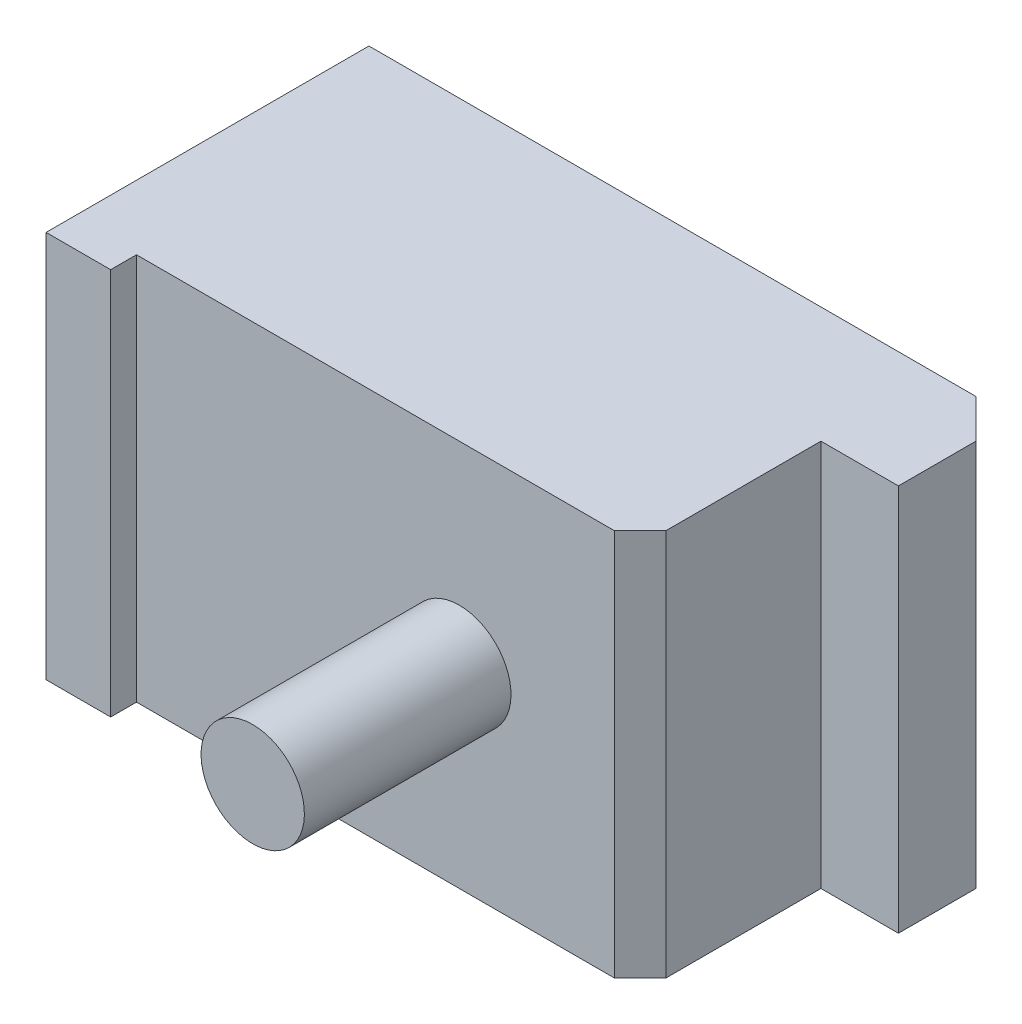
ISO-10303-21;
HEADER;
FILE_DESCRIPTION(('STEP AP214'),'2;1');
FILE_NAME('part.step','',(''),(''),'','','');
FILE_SCHEMA(('AUTOMOTIVE_DESIGN { 1 0 10303 214 1 1 1 1 }'));
ENDSEC;
DATA;
#1=APPLICATION_CONTEXT('core data for automotive mechanical design processes');
#2=APPLICATION_PROTOCOL_DEFINITION('international standard','automotive_design',2000,#1);
#3=PRODUCT_CONTEXT('',#1,'mechanical');
#4=PRODUCT('Part','Part','',(#3));
#5=PRODUCT_RELATED_PRODUCT_CATEGORY('part','',(#4));
#6=PRODUCT_DEFINITION_FORMATION('','',#4);
#7=PRODUCT_DEFINITION_CONTEXT('part definition',#1,'design');
#8=PRODUCT_DEFINITION('design','',#6,#7);
#9=PRODUCT_DEFINITION_SHAPE('','',#8);
#10=(LENGTH_UNIT() NAMED_UNIT(*) SI_UNIT(.MILLI.,.METRE.));
#11=(NAMED_UNIT(*) PLANE_ANGLE_UNIT() SI_UNIT($,.RADIAN.));
#12=(NAMED_UNIT(*) SI_UNIT($,.STERADIAN.) SOLID_ANGLE_UNIT());
#13=UNCERTAINTY_MEASURE_WITH_UNIT(LENGTH_MEASURE(1.E-05),#10,'distance_accuracy_value','');
#14=(GEOMETRIC_REPRESENTATION_CONTEXT(3) GLOBAL_UNCERTAINTY_ASSIGNED_CONTEXT((#13)) GLOBAL_UNIT_ASSIGNED_CONTEXT((#10,
#11,#12)) REPRESENTATION_CONTEXT('',''));
#15=CARTESIAN_POINT('',(0.,0.,0.));
#16=DIRECTION('',(0.,0.,1.));
#17=DIRECTION('',(1.,0.,0.));
#18=AXIS2_PLACEMENT_3D('',#15,#16,#17);
#19=CARTESIAN_POINT('',(25.,-15.,2.));
#20=DIRECTION('',(0.,-1.,0.));
#21=DIRECTION('',(0.,0.,-1.));
#22=AXIS2_PLACEMENT_3D('',#19,#20,#21);
#23=PLANE('',#22);
#24=DIRECTION('',(0.,0.,-1.));
#25=VECTOR('',#24,1.);
#26=CARTESIAN_POINT('',(19.,-15.,2.));
#27=LINE('',#26,#25);
#28=CARTESIAN_POINT('',(19.,-15.,-2.));
#29=VERTEX_POINT('',#28);
#30=CARTESIAN_POINT('',(19.,-15.,-14.));
#31=VERTEX_POINT('',#30);
#32=EDGE_CURVE('E213',#29,#31,#27,.T.);
#33=ORIENTED_EDGE('',*,*,#32,.F.);
#34=DIRECTION('',(0.707106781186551,0.,-0.707106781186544));
#35=VECTOR('',#34,1.);
#36=CARTESIAN_POINT('',(20.,-15.,-3.));
#37=LINE('',#36,#35);
#38=CARTESIAN_POINT('',(17.,-15.,0.));
#39=VERTEX_POINT('',#38);
#40=EDGE_CURVE('E39',#29,#39,#37,.F.);
#41=ORIENTED_EDGE('',*,*,#40,.T.);
#42=DIRECTION('',(1.,0.,0.));
#43=VECTOR('',#42,1.);
#44=CARTESIAN_POINT('',(-20.,-15.,0.));
#45=LINE('',#44,#43);
#46=CARTESIAN_POINT('',(-20.,-15.,0.));
#47=VERTEX_POINT('',#46);
#48=EDGE_CURVE('E205',#47,#39,#45,.T.);
#49=ORIENTED_EDGE('',*,*,#48,.F.);
#50=DIRECTION('',(0.,0.,-1.));
#51=VECTOR('',#50,1.);
#52=CARTESIAN_POINT('',(-20.,-15.,2.));
#53=LINE('',#52,#51);
#54=CARTESIAN_POINT('',(-20.,-15.,2.));
#55=VERTEX_POINT('',#54);
#56=EDGE_CURVE('E200',#55,#47,#53,.T.);
#57=ORIENTED_EDGE('',*,*,#56,.F.);
#58=DIRECTION('',(-1.,0.,0.));
#59=VECTOR('',#58,1.);
#60=CARTESIAN_POINT('',(25.,-15.,2.));
#61=LINE('',#60,#59);
#62=CARTESIAN_POINT('',(-25.,-15.,2.));
#63=VERTEX_POINT('',#62);
#64=EDGE_CURVE('E230',#55,#63,#61,.T.);
#65=ORIENTED_EDGE('',*,*,#64,.T.);
#66=DIRECTION('',(0.,0.,-1.));
#67=VECTOR('',#66,1.);
#68=CARTESIAN_POINT('',(-25.,-15.,2.));
#69=LINE('',#68,#67);
#70=CARTESIAN_POINT('',(-25.,-15.,-23.));
#71=VERTEX_POINT('',#70);
#72=EDGE_CURVE('E239',#63,#71,#69,.T.);
#73=ORIENTED_EDGE('',*,*,#72,.T.);
#74=DIRECTION('',(-1.,0.,0.));
#75=VECTOR('',#74,1.);
#76=CARTESIAN_POINT('',(25.,-15.,-23.));
#77=LINE('',#76,#75);
#78=CARTESIAN_POINT('',(22.,-15.,-23.));
#79=VERTEX_POINT('',#78);
#80=EDGE_CURVE('E227',#79,#71,#77,.T.);
#81=ORIENTED_EDGE('',*,*,#80,.F.);
#82=DIRECTION('',(-0.707106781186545,0.,-0.70710678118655));
#83=VECTOR('',#82,1.);
#84=CARTESIAN_POINT('',(36.,-15.,-9.));
#85=LINE('',#84,#83);
#86=CARTESIAN_POINT('',(25.,-15.,-20.));
#87=VERTEX_POINT('',#86);
#88=EDGE_CURVE('E262',#79,#87,#85,.F.);
#89=ORIENTED_EDGE('',*,*,#88,.T.);
#90=DIRECTION('',(0.,0.,-1.));
#91=VECTOR('',#90,1.);
#92=CARTESIAN_POINT('',(25.,-15.,2.));
#93=LINE('',#92,#91);
#94=CARTESIAN_POINT('',(25.,-15.,-14.));
#95=VERTEX_POINT('',#94);
#96=EDGE_CURVE('E246',#95,#87,#93,.T.);
#97=ORIENTED_EDGE('',*,*,#96,.F.);
#98=DIRECTION('',(1.,0.,0.));
#99=VECTOR('',#98,1.);
#100=CARTESIAN_POINT('',(19.,-15.,-14.));
#101=LINE('',#100,#99);
#102=EDGE_CURVE('E218',#31,#95,#101,.T.);
#103=ORIENTED_EDGE('',*,*,#102,.F.);
#104=EDGE_LOOP('',(#33,#41,#49,#57,#65,#73,#81,#89,#97,#103));
#105=FACE_BOUND('',#104,.T.);
#106=ADVANCED_FACE('F16',(#105),#23,.T.);
#107=CARTESIAN_POINT('',(25.,15.,2.));
#108=DIRECTION('',(1.,0.,0.));
#109=DIRECTION('',(0.,0.,-1.));
#110=AXIS2_PLACEMENT_3D('',#107,#108,#109);
#111=PLANE('',#110);
#112=ORIENTED_EDGE('',*,*,#96,.T.);
#113=DIRECTION('',(0.,1.,0.));
#114=VECTOR('',#113,1.);
#115=CARTESIAN_POINT('',(25.,15.,-20.));
#116=LINE('',#115,#114);
#117=CARTESIAN_POINT('',(25.,15.,-20.));
#118=VERTEX_POINT('',#117);
#119=EDGE_CURVE('E264',#87,#118,#116,.T.);
#120=ORIENTED_EDGE('',*,*,#119,.T.);
#121=DIRECTION('',(0.,0.,-1.));
#122=VECTOR('',#121,1.);
#123=CARTESIAN_POINT('',(25.,15.,2.));
#124=LINE('',#123,#122);
#125=CARTESIAN_POINT('',(25.,15.,-14.));
#126=VERTEX_POINT('',#125);
#127=EDGE_CURVE('E250',#126,#118,#124,.T.);
#128=ORIENTED_EDGE('',*,*,#127,.F.);
#129=DIRECTION('',(0.,-1.,0.));
#130=VECTOR('',#129,1.);
#131=CARTESIAN_POINT('',(25.,15.,-14.));
#132=LINE('',#131,#130);
#133=EDGE_CURVE('E224',#126,#95,#132,.T.);
#134=ORIENTED_EDGE('',*,*,#133,.T.);
#135=EDGE_LOOP('',(#112,#120,#128,#134));
#136=FACE_BOUND('',#135,.T.);
#137=ADVANCED_FACE('F285',(#136),#111,.T.);
#138=CARTESIAN_POINT('',(-25.,15.,2.));
#139=DIRECTION('',(0.,1.,0.));
#140=DIRECTION('',(0.,0.,1.));
#141=AXIS2_PLACEMENT_3D('',#138,#139,#140);
#142=PLANE('',#141);
#143=DIRECTION('',(1.,0.,0.));
#144=VECTOR('',#143,1.);
#145=CARTESIAN_POINT('',(-20.,15.,0.));
#146=LINE('',#145,#144);
#147=CARTESIAN_POINT('',(-20.,15.,0.));
#148=VERTEX_POINT('',#147);
#149=CARTESIAN_POINT('',(17.,15.,0.));
#150=VERTEX_POINT('',#149);
#151=EDGE_CURVE('E204',#148,#150,#146,.T.);
#152=ORIENTED_EDGE('',*,*,#151,.T.);
#153=DIRECTION('',(-0.707106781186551,0.,0.707106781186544));
#154=VECTOR('',#153,1.);
#155=CARTESIAN_POINT('',(-5.00000000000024,15.,22.));
#156=LINE('',#155,#154);
#157=CARTESIAN_POINT('',(19.,15.,-2.));
#158=VERTEX_POINT('',#157);
#159=EDGE_CURVE('E10',#150,#158,#156,.F.);
#160=ORIENTED_EDGE('',*,*,#159,.T.);
#161=DIRECTION('',(0.,0.,-1.));
#162=VECTOR('',#161,1.);
#163=CARTESIAN_POINT('',(19.,15.,2.));
#164=LINE('',#163,#162);
#165=CARTESIAN_POINT('',(19.,15.,-14.));
#166=VERTEX_POINT('',#165);
#167=EDGE_CURVE('E215',#158,#166,#164,.T.);
#168=ORIENTED_EDGE('',*,*,#167,.T.);
#169=DIRECTION('',(1.,0.,0.));
#170=VECTOR('',#169,1.);
#171=CARTESIAN_POINT('',(19.,15.,-14.));
#172=LINE('',#171,#170);
#173=EDGE_CURVE('E217',#166,#126,#172,.T.);
#174=ORIENTED_EDGE('',*,*,#173,.T.);
#175=ORIENTED_EDGE('',*,*,#127,.T.);
#176=DIRECTION('',(0.707106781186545,0.,0.70710678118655));
#177=VECTOR('',#176,1.);
#178=CARTESIAN_POINT('',(11.0000000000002,15.,-34.));
#179=LINE('',#178,#177);
#180=CARTESIAN_POINT('',(22.,15.,-23.));
#181=VERTEX_POINT('',#180);
#182=EDGE_CURVE('E266',#118,#181,#179,.F.);
#183=ORIENTED_EDGE('',*,*,#182,.T.);
#184=DIRECTION('',(1.,0.,0.));
#185=VECTOR('',#184,1.);
#186=CARTESIAN_POINT('',(-25.,15.,-23.));
#187=LINE('',#186,#185);
#188=CARTESIAN_POINT('',(-25.,15.,-23.));
#189=VERTEX_POINT('',#188);
#190=EDGE_CURVE('E233',#189,#181,#187,.T.);
#191=ORIENTED_EDGE('',*,*,#190,.F.);
#192=DIRECTION('',(0.,0.,-1.));
#193=VECTOR('',#192,1.);
#194=CARTESIAN_POINT('',(-25.,15.,2.));
#195=LINE('',#194,#193);
#196=CARTESIAN_POINT('',(-25.,15.,2.));
#197=VERTEX_POINT('',#196);
#198=EDGE_CURVE('E253',#197,#189,#195,.T.);
#199=ORIENTED_EDGE('',*,*,#198,.F.);
#200=DIRECTION('',(1.,0.,0.));
#201=VECTOR('',#200,1.);
#202=CARTESIAN_POINT('',(-25.,15.,2.));
#203=LINE('',#202,#201);
#204=CARTESIAN_POINT('',(-20.,15.,2.));
#205=VERTEX_POINT('',#204);
#206=EDGE_CURVE('E236',#197,#205,#203,.T.);
#207=ORIENTED_EDGE('',*,*,#206,.T.);
#208=DIRECTION('',(0.,0.,-1.));
#209=VECTOR('',#208,1.);
#210=CARTESIAN_POINT('',(-20.,15.,2.));
#211=LINE('',#210,#209);
#212=EDGE_CURVE('E201',#205,#148,#211,.T.);
#213=ORIENTED_EDGE('',*,*,#212,.T.);
#214=EDGE_LOOP('',(#152,#160,#168,#174,#175,#183,#191,#199,#207,#213));
#215=FACE_BOUND('',#214,.T.);
#216=ADVANCED_FACE('F289',(#215),#142,.T.);
#217=CARTESIAN_POINT('',(-25.,-15.,2.));
#218=DIRECTION('',(-1.,0.,0.));
#219=DIRECTION('',(0.,0.,1.));
#220=AXIS2_PLACEMENT_3D('',#217,#218,#219);
#221=PLANE('',#220);
#222=DIRECTION('',(0.,1.,0.));
#223=VECTOR('',#222,1.);
#224=CARTESIAN_POINT('',(-25.,-15.,-23.));
#225=LINE('',#224,#223);
#226=EDGE_CURVE('E241',#71,#189,#225,.T.);
#227=ORIENTED_EDGE('',*,*,#226,.F.);
#228=ORIENTED_EDGE('',*,*,#72,.F.);
#229=DIRECTION('',(0.,1.,0.));
#230=VECTOR('',#229,1.);
#231=CARTESIAN_POINT('',(-25.,-15.,2.));
#232=LINE('',#231,#230);
#233=EDGE_CURVE('E232',#63,#197,#232,.T.);
#234=ORIENTED_EDGE('',*,*,#233,.T.);
#235=ORIENTED_EDGE('',*,*,#198,.T.);
#236=EDGE_LOOP('',(#227,#228,#234,#235));
#237=FACE_BOUND('',#236,.T.);
#238=ADVANCED_FACE('F303',(#237),#221,.T.);
#239=CARTESIAN_POINT('',(0.,0.,2.));
#240=DIRECTION('',(0.,0.,-1.));
#241=DIRECTION('',(-1.,0.,0.));
#242=AXIS2_PLACEMENT_3D('',#239,#240,#241);
#243=PLANE('',#242);
#244=ORIENTED_EDGE('',*,*,#64,.F.);
#245=DIRECTION('',(0.,-1.,0.));
#246=VECTOR('',#245,1.);
#247=CARTESIAN_POINT('',(-20.,15.,2.));
#248=LINE('',#247,#246);
#249=EDGE_CURVE('E207',#205,#55,#248,.T.);
#250=ORIENTED_EDGE('',*,*,#249,.F.);
#251=ORIENTED_EDGE('',*,*,#206,.F.);
#252=ORIENTED_EDGE('',*,*,#233,.F.);
#253=EDGE_LOOP('',(#244,#250,#251,#252));
#254=FACE_BOUND('',#253,.T.);
#255=ADVANCED_FACE('F307',(#254),#243,.F.);
#256=CARTESIAN_POINT('',(0.,0.,-23.));
#257=DIRECTION('',(0.,0.,-1.));
#258=DIRECTION('',(-1.,0.,0.));
#259=AXIS2_PLACEMENT_3D('',#256,#257,#258);
#260=PLANE('',#259);
#261=CARTESIAN_POINT('',(5.,0.,-23.));
#262=DIRECTION('',(0.,0.,-1.));
#263=DIRECTION('',(0.,1.,0.));
#264=AXIS2_PLACEMENT_3D('',#261,#262,#263);
#265=CIRCLE('',#264,7.);
#266=CARTESIAN_POINT('',(5.,7.,-23.));
#267=VERTEX_POINT('',#266);
#268=EDGE_CURVE('E194',#267,#267,#265,.T.);
#269=ORIENTED_EDGE('',*,*,#268,.F.);
#270=EDGE_LOOP('',(#269));
#271=FACE_BOUND('',#270,.T.);
#272=ORIENTED_EDGE('',*,*,#190,.T.);
#273=DIRECTION('',(0.,-1.,0.));
#274=VECTOR('',#273,1.);
#275=CARTESIAN_POINT('',(22.,0.,-23.));
#276=LINE('',#275,#274);
#277=EDGE_CURVE('E259',#181,#79,#276,.T.);
#278=ORIENTED_EDGE('',*,*,#277,.T.);
#279=ORIENTED_EDGE('',*,*,#80,.T.);
#280=ORIENTED_EDGE('',*,*,#226,.T.);
#281=EDGE_LOOP('',(#272,#278,#279,#280));
#282=FACE_BOUND('',#281,.T.);
#283=ADVANCED_FACE('F296',(#271,#282),#260,.T.);
#284=CARTESIAN_POINT('',(19.,15.,-14.));
#285=DIRECTION('',(0.,0.,-1.));
#286=DIRECTION('',(-1.,0.,0.));
#287=AXIS2_PLACEMENT_3D('',#284,#285,#286);
#288=PLANE('',#287);
#289=ORIENTED_EDGE('',*,*,#102,.T.);
#290=ORIENTED_EDGE('',*,*,#133,.F.);
#291=ORIENTED_EDGE('',*,*,#173,.F.);
#292=DIRECTION('',(0.,-1.,0.));
#293=VECTOR('',#292,1.);
#294=CARTESIAN_POINT('',(19.,15.,-14.));
#295=LINE('',#294,#293);
#296=EDGE_CURVE('E221',#166,#31,#295,.T.);
#297=ORIENTED_EDGE('',*,*,#296,.T.);
#298=EDGE_LOOP('',(#289,#290,#291,#297));
#299=FACE_BOUND('',#298,.T.);
#300=ADVANCED_FACE('F281',(#299),#288,.F.);
#301=CARTESIAN_POINT('',(19.,15.,2.));
#302=DIRECTION('',(-1.,0.,0.));
#303=DIRECTION('',(0.,0.,1.));
#304=AXIS2_PLACEMENT_3D('',#301,#302,#303);
#305=PLANE('',#304);
#306=ORIENTED_EDGE('',*,*,#167,.F.);
#307=DIRECTION('',(0.,-1.,0.));
#308=VECTOR('',#307,1.);
#309=CARTESIAN_POINT('',(19.,15.,-2.));
#310=LINE('',#309,#308);
#311=EDGE_CURVE('E268',#158,#29,#310,.T.);
#312=ORIENTED_EDGE('',*,*,#311,.T.);
#313=ORIENTED_EDGE('',*,*,#32,.T.);
#314=ORIENTED_EDGE('',*,*,#296,.F.);
#315=EDGE_LOOP('',(#306,#312,#313,#314));
#316=FACE_BOUND('',#315,.T.);
#317=ADVANCED_FACE('F274',(#316),#305,.F.);
#318=CARTESIAN_POINT('',(-20.,15.,0.));
#319=DIRECTION('',(0.,0.,-1.));
#320=DIRECTION('',(-1.,0.,0.));
#321=AXIS2_PLACEMENT_3D('',#318,#319,#320);
#322=PLANE('',#321);
#323=CARTESIAN_POINT('',(5.,0.,0.));
#324=DIRECTION('',(0.,0.,-1.));
#325=DIRECTION('',(0.,1.,0.));
#326=AXIS2_PLACEMENT_3D('',#323,#324,#325);
#327=CIRCLE('',#326,4.00000000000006);
#328=CARTESIAN_POINT('',(5.,4.00000000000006,0.));
#329=VERTEX_POINT('',#328);
#330=EDGE_CURVE('E401',#329,#329,#327,.T.);
#331=ORIENTED_EDGE('',*,*,#330,.T.);
#332=EDGE_LOOP('',(#331));
#333=FACE_BOUND('',#332,.T.);
#334=ORIENTED_EDGE('',*,*,#48,.T.);
#335=DIRECTION('',(0.,1.,0.));
#336=VECTOR('',#335,1.);
#337=CARTESIAN_POINT('',(17.,15.,0.));
#338=LINE('',#337,#336);
#339=EDGE_CURVE('E25',#39,#150,#338,.T.);
#340=ORIENTED_EDGE('',*,*,#339,.T.);
#341=ORIENTED_EDGE('',*,*,#151,.F.);
#342=DIRECTION('',(0.,-1.,0.));
#343=VECTOR('',#342,1.);
#344=CARTESIAN_POINT('',(-20.,15.,0.));
#345=LINE('',#344,#343);
#346=EDGE_CURVE('E211',#148,#47,#345,.T.);
#347=ORIENTED_EDGE('',*,*,#346,.T.);
#348=EDGE_LOOP('',(#334,#340,#341,#347));
#349=FACE_BOUND('',#348,.T.);
#350=ADVANCED_FACE('F310',(#333,#349),#322,.F.);
#351=CARTESIAN_POINT('',(-20.,15.,2.));
#352=DIRECTION('',(-1.,0.,0.));
#353=DIRECTION('',(0.,0.,1.));
#354=AXIS2_PLACEMENT_3D('',#351,#352,#353);
#355=PLANE('',#354);
#356=ORIENTED_EDGE('',*,*,#56,.T.);
#357=ORIENTED_EDGE('',*,*,#346,.F.);
#358=ORIENTED_EDGE('',*,*,#212,.F.);
#359=ORIENTED_EDGE('',*,*,#249,.T.);
#360=EDGE_LOOP('',(#356,#357,#358,#359));
#361=FACE_BOUND('',#360,.T.);
#362=ADVANCED_FACE('F309',(#361),#355,.F.);
#363=CARTESIAN_POINT('',(5.,0.,-14.));
#364=DIRECTION('',(0.,0.,1.));
#365=DIRECTION('',(0.,-1.,0.));
#366=AXIS2_PLACEMENT_3D('',#363,#364,#365);
#367=PLANE('',#366);
#368=CARTESIAN_POINT('',(5.,0.,-14.));
#369=DIRECTION('',(0.,0.,1.));
#370=DIRECTION('',(0.,-1.,0.));
#371=AXIS2_PLACEMENT_3D('',#368,#369,#370);
#372=CIRCLE('',#371,6.5);
#373=CARTESIAN_POINT('',(5.,-6.5,-14.));
#374=VERTEX_POINT('',#373);
#375=EDGE_CURVE('E249',#374,#374,#372,.F.);
#376=ORIENTED_EDGE('',*,*,#375,.F.);
#377=EDGE_LOOP('',(#376));
#378=FACE_BOUND('',#377,.T.);
#379=CARTESIAN_POINT('',(5.,0.,-14.));
#380=DIRECTION('',(0.,0.,-1.));
#381=DIRECTION('',(0.,1.,0.));
#382=AXIS2_PLACEMENT_3D('',#379,#380,#381);
#383=CIRCLE('',#382,7.);
#384=CARTESIAN_POINT('',(5.,7.,-14.));
#385=VERTEX_POINT('',#384);
#386=EDGE_CURVE('E197',#385,#385,#383,.T.);
#387=ORIENTED_EDGE('',*,*,#386,.T.);
#388=EDGE_LOOP('',(#387));
#389=FACE_BOUND('',#388,.T.);
#390=ADVANCED_FACE('F349',(#378,#389),#367,.F.);
#391=CARTESIAN_POINT('',(5.,0.,-23.));
#392=DIRECTION('',(0.,0.,-1.));
#393=DIRECTION('',(0.,1.,0.));
#394=AXIS2_PLACEMENT_3D('',#391,#392,#393);
#395=CYLINDRICAL_SURFACE('',#394,7.);
#396=ORIENTED_EDGE('',*,*,#386,.F.);
#397=EDGE_LOOP('',(#396));
#398=FACE_BOUND('',#397,.T.);
#399=ORIENTED_EDGE('',*,*,#268,.T.);
#400=EDGE_LOOP('',(#399));
#401=FACE_BOUND('',#400,.T.);
#402=ADVANCED_FACE('F355',(#398,#401),#395,.F.);
#403=CARTESIAN_POINT('',(5.,0.,-22.));
#404=DIRECTION('',(0.,0.,1.));
#405=DIRECTION('',(0.,-1.,0.));
#406=AXIS2_PLACEMENT_3D('',#403,#404,#405);
#407=CYLINDRICAL_SURFACE('',#406,6.5);
#408=CARTESIAN_POINT('',(5.,0.,-22.));
#409=DIRECTION('',(0.,0.,-1.));
#410=DIRECTION('',(0.,1.,0.));
#411=AXIS2_PLACEMENT_3D('',#408,#409,#410);
#412=CIRCLE('',#411,6.5);
#413=CARTESIAN_POINT('',(5.,6.5,-22.));
#414=VERTEX_POINT('',#413);
#415=EDGE_CURVE('E184',#414,#414,#412,.T.);
#416=ORIENTED_EDGE('',*,*,#415,.F.);
#417=EDGE_LOOP('',(#416));
#418=FACE_BOUND('',#417,.T.);
#419=ORIENTED_EDGE('',*,*,#375,.T.);
#420=EDGE_LOOP('',(#419));
#421=FACE_BOUND('',#420,.T.);
#422=ADVANCED_FACE('F359',(#418,#421),#407,.T.);
#423=CARTESIAN_POINT('',(5.,0.,-22.));
#424=DIRECTION('',(0.,0.,-1.));
#425=DIRECTION('',(0.,1.,0.));
#426=AXIS2_PLACEMENT_3D('',#423,#424,#425);
#427=PLANE('',#426);
#428=DIRECTION('',(-0.5,0.866025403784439,0.));
#429=VECTOR('',#428,1.);
#430=CARTESIAN_POINT('',(3.26794919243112,-3.,-22.));
#431=LINE('',#430,#429);
#432=CARTESIAN_POINT('',(3.26794919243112,-3.,-22.));
#433=VERTEX_POINT('',#432);
#434=CARTESIAN_POINT('',(1.53589838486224,0.,-22.));
#435=VERTEX_POINT('',#434);
#436=EDGE_CURVE('E137',#433,#435,#431,.T.);
#437=ORIENTED_EDGE('',*,*,#436,.F.);
#438=DIRECTION('',(-1.,0.,0.));
#439=VECTOR('',#438,1.);
#440=CARTESIAN_POINT('',(6.73205080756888,-3.,-22.));
#441=LINE('',#440,#439);
#442=CARTESIAN_POINT('',(6.73205080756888,-3.,-22.));
#443=VERTEX_POINT('',#442);
#444=EDGE_CURVE('E155',#443,#433,#441,.T.);
#445=ORIENTED_EDGE('',*,*,#444,.F.);
#446=DIRECTION('',(-0.5,-0.866025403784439,0.));
#447=VECTOR('',#446,1.);
#448=CARTESIAN_POINT('',(8.46410161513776,0.,-22.));
#449=LINE('',#448,#447);
#450=CARTESIAN_POINT('',(8.46410161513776,0.,-22.));
#451=VERTEX_POINT('',#450);
#452=EDGE_CURVE('E158',#451,#443,#449,.T.);
#453=ORIENTED_EDGE('',*,*,#452,.F.);
#454=DIRECTION('',(0.5,-0.866025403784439,0.));
#455=VECTOR('',#454,1.);
#456=CARTESIAN_POINT('',(6.73205080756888,3.,-22.));
#457=LINE('',#456,#455);
#458=CARTESIAN_POINT('',(6.73205080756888,3.,-22.));
#459=VERTEX_POINT('',#458);
#460=EDGE_CURVE('E177',#459,#451,#457,.T.);
#461=ORIENTED_EDGE('',*,*,#460,.F.);
#462=DIRECTION('',(1.,0.,0.));
#463=VECTOR('',#462,1.);
#464=CARTESIAN_POINT('',(3.26794919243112,3.,-22.));
#465=LINE('',#464,#463);
#466=CARTESIAN_POINT('',(3.26794919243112,3.,-22.));
#467=VERTEX_POINT('',#466);
#468=EDGE_CURVE('E174',#467,#459,#465,.T.);
#469=ORIENTED_EDGE('',*,*,#468,.F.);
#470=DIRECTION('',(0.5,0.866025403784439,0.));
#471=VECTOR('',#470,1.);
#472=CARTESIAN_POINT('',(1.53589838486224,0.,-22.));
#473=LINE('',#472,#471);
#474=EDGE_CURVE('E172',#435,#467,#473,.T.);
#475=ORIENTED_EDGE('',*,*,#474,.F.);
#476=EDGE_LOOP('',(#437,#445,#453,#461,#469,#475));
#477=FACE_BOUND('',#476,.T.);
#478=ORIENTED_EDGE('',*,*,#415,.T.);
#479=EDGE_LOOP('',(#478));
#480=FACE_BOUND('',#479,.T.);
#481=ADVANCED_FACE('F363',(#477,#480),#427,.T.);
#482=CARTESIAN_POINT('',(3.26794919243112,-3.,-16.3199999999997));
#483=DIRECTION('',(-0.866025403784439,-0.5,0.));
#484=DIRECTION('',(0.5,-0.866025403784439,0.));
#485=AXIS2_PLACEMENT_3D('',#482,#483,#484);
#486=PLANE('',#485);
#487=ORIENTED_EDGE('',*,*,#436,.T.);
#488=DIRECTION('',(0.,0.,-1.));
#489=VECTOR('',#488,1.);
#490=CARTESIAN_POINT('',(1.53589838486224,0.,-16.3199999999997));
#491=LINE('',#490,#489);
#492=CARTESIAN_POINT('',(1.53589838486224,0.,-16.3199999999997));
#493=VERTEX_POINT('',#492);
#494=EDGE_CURVE('E130',#493,#435,#491,.T.);
#495=ORIENTED_EDGE('',*,*,#494,.F.);
#496=DIRECTION('',(-0.5,0.866025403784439,0.));
#497=VECTOR('',#496,1.);
#498=CARTESIAN_POINT('',(3.26794919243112,-3.,-16.3199999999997));
#499=LINE('',#498,#497);
#500=CARTESIAN_POINT('',(3.26794919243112,-3.,-16.3199999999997));
#501=VERTEX_POINT('',#500);
#502=EDGE_CURVE('E134',#501,#493,#499,.T.);
#503=ORIENTED_EDGE('',*,*,#502,.F.);
#504=DIRECTION('',(0.,0.,-1.));
#505=VECTOR('',#504,1.);
#506=CARTESIAN_POINT('',(3.26794919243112,-3.,-16.3199999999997));
#507=LINE('',#506,#505);
#508=EDGE_CURVE('E182',#501,#433,#507,.T.);
#509=ORIENTED_EDGE('',*,*,#508,.T.);
#510=EDGE_LOOP('',(#487,#495,#503,#509));
#511=FACE_BOUND('',#510,.T.);
#512=ADVANCED_FACE('F132',(#511),#486,.F.);
#513=CARTESIAN_POINT('',(6.73205080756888,-3.,-16.3199999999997));
#514=DIRECTION('',(0.,-1.,0.));
#515=DIRECTION('',(0.,0.,-1.));
#516=AXIS2_PLACEMENT_3D('',#513,#514,#515);
#517=PLANE('',#516);
#518=ORIENTED_EDGE('',*,*,#444,.T.);
#519=ORIENTED_EDGE('',*,*,#508,.F.);
#520=DIRECTION('',(-1.,0.,0.));
#521=VECTOR('',#520,1.);
#522=CARTESIAN_POINT('',(6.73205080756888,-3.,-16.3199999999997));
#523=LINE('',#522,#521);
#524=CARTESIAN_POINT('',(6.73205080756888,-3.,-16.3199999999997));
#525=VERTEX_POINT('',#524);
#526=EDGE_CURVE('E142',#525,#501,#523,.T.);
#527=ORIENTED_EDGE('',*,*,#526,.F.);
#528=DIRECTION('',(0.,0.,-1.));
#529=VECTOR('',#528,1.);
#530=CARTESIAN_POINT('',(6.73205080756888,-3.,-16.3199999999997));
#531=LINE('',#530,#529);
#532=EDGE_CURVE('E185',#525,#443,#531,.T.);
#533=ORIENTED_EDGE('',*,*,#532,.T.);
#534=EDGE_LOOP('',(#518,#519,#527,#533));
#535=FACE_BOUND('',#534,.T.);
#536=ADVANCED_FACE('F370',(#535),#517,.F.);
#537=CARTESIAN_POINT('',(8.46410161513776,0.,-16.3199999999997));
#538=DIRECTION('',(0.866025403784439,-0.5,0.));
#539=DIRECTION('',(0.5,0.866025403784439,0.));
#540=AXIS2_PLACEMENT_3D('',#537,#538,#539);
#541=PLANE('',#540);
#542=ORIENTED_EDGE('',*,*,#452,.T.);
#543=ORIENTED_EDGE('',*,*,#532,.F.);
#544=DIRECTION('',(-0.5,-0.866025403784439,0.));
#545=VECTOR('',#544,1.);
#546=CARTESIAN_POINT('',(8.46410161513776,0.,-16.3199999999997));
#547=LINE('',#546,#545);
#548=CARTESIAN_POINT('',(8.46410161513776,0.,-16.3199999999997));
#549=VERTEX_POINT('',#548);
#550=EDGE_CURVE('E168',#549,#525,#547,.T.);
#551=ORIENTED_EDGE('',*,*,#550,.F.);
#552=DIRECTION('',(0.,0.,-1.));
#553=VECTOR('',#552,1.);
#554=CARTESIAN_POINT('',(8.46410161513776,0.,-16.3199999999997));
#555=LINE('',#554,#553);
#556=EDGE_CURVE('E187',#549,#451,#555,.T.);
#557=ORIENTED_EDGE('',*,*,#556,.T.);
#558=EDGE_LOOP('',(#542,#543,#551,#557));
#559=FACE_BOUND('',#558,.T.);
#560=ADVANCED_FACE('F380',(#559),#541,.F.);
#561=CARTESIAN_POINT('',(6.73205080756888,3.,-16.3199999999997));
#562=DIRECTION('',(0.866025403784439,0.5,0.));
#563=DIRECTION('',(-0.5,0.866025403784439,0.));
#564=AXIS2_PLACEMENT_3D('',#561,#562,#563);
#565=PLANE('',#564);
#566=ORIENTED_EDGE('',*,*,#460,.T.);
#567=ORIENTED_EDGE('',*,*,#556,.F.);
#568=DIRECTION('',(0.5,-0.866025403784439,0.));
#569=VECTOR('',#568,1.);
#570=CARTESIAN_POINT('',(6.73205080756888,3.,-16.3199999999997));
#571=LINE('',#570,#569);
#572=CARTESIAN_POINT('',(6.73205080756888,3.,-16.3199999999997));
#573=VERTEX_POINT('',#572);
#574=EDGE_CURVE('E165',#573,#549,#571,.T.);
#575=ORIENTED_EDGE('',*,*,#574,.F.);
#576=DIRECTION('',(0.,0.,-1.));
#577=VECTOR('',#576,1.);
#578=CARTESIAN_POINT('',(6.73205080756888,3.,-16.3199999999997));
#579=LINE('',#578,#577);
#580=EDGE_CURVE('E189',#573,#459,#579,.T.);
#581=ORIENTED_EDGE('',*,*,#580,.T.);
#582=EDGE_LOOP('',(#566,#567,#575,#581));
#583=FACE_BOUND('',#582,.T.);
#584=ADVANCED_FACE('F376',(#583),#565,.F.);
#585=CARTESIAN_POINT('',(3.26794919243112,3.,-16.3199999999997));
#586=DIRECTION('',(0.,1.,0.));
#587=DIRECTION('',(-1.,0.,0.));
#588=AXIS2_PLACEMENT_3D('',#585,#586,#587);
#589=PLANE('',#588);
#590=ORIENTED_EDGE('',*,*,#468,.T.);
#591=ORIENTED_EDGE('',*,*,#580,.F.);
#592=DIRECTION('',(1.,0.,0.));
#593=VECTOR('',#592,1.);
#594=CARTESIAN_POINT('',(3.26794919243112,3.,-16.3199999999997));
#595=LINE('',#594,#593);
#596=CARTESIAN_POINT('',(3.26794919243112,3.,-16.3199999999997));
#597=VERTEX_POINT('',#596);
#598=EDGE_CURVE('E150',#597,#573,#595,.T.);
#599=ORIENTED_EDGE('',*,*,#598,.F.);
#600=DIRECTION('',(0.,0.,-1.));
#601=VECTOR('',#600,1.);
#602=CARTESIAN_POINT('',(3.26794919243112,3.,-16.3199999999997));
#603=LINE('',#602,#601);
#604=EDGE_CURVE('E141',#597,#467,#603,.T.);
#605=ORIENTED_EDGE('',*,*,#604,.T.);
#606=EDGE_LOOP('',(#590,#591,#599,#605));
#607=FACE_BOUND('',#606,.T.);
#608=ADVANCED_FACE('F373',(#607),#589,.F.);
#609=CARTESIAN_POINT('',(1.53589838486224,0.,-16.3199999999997));
#610=DIRECTION('',(-0.866025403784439,0.5,0.));
#611=DIRECTION('',(-0.5,-0.866025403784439,0.));
#612=AXIS2_PLACEMENT_3D('',#609,#610,#611);
#613=PLANE('',#612);
#614=ORIENTED_EDGE('',*,*,#474,.T.);
#615=ORIENTED_EDGE('',*,*,#604,.F.);
#616=DIRECTION('',(0.5,0.866025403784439,0.));
#617=VECTOR('',#616,1.);
#618=CARTESIAN_POINT('',(1.53589838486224,0.,-16.3199999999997));
#619=LINE('',#618,#617);
#620=EDGE_CURVE('E145',#493,#597,#619,.T.);
#621=ORIENTED_EDGE('',*,*,#620,.F.);
#622=ORIENTED_EDGE('',*,*,#494,.T.);
#623=EDGE_LOOP('',(#614,#615,#621,#622));
#624=FACE_BOUND('',#623,.T.);
#625=ADVANCED_FACE('F146',(#624),#613,.F.);
#626=CARTESIAN_POINT('',(0.,0.,-16.3199999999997));
#627=DIRECTION('',(0.,0.,-1.));
#628=DIRECTION('',(-1.,0.,0.));
#629=AXIS2_PLACEMENT_3D('',#626,#627,#628);
#630=PLANE('',#629);
#631=ORIENTED_EDGE('',*,*,#502,.T.);
#632=ORIENTED_EDGE('',*,*,#620,.T.);
#633=ORIENTED_EDGE('',*,*,#598,.T.);
#634=ORIENTED_EDGE('',*,*,#574,.T.);
#635=ORIENTED_EDGE('',*,*,#550,.T.);
#636=ORIENTED_EDGE('',*,*,#526,.T.);
#637=EDGE_LOOP('',(#631,#632,#633,#634,#635,#636));
#638=FACE_BOUND('',#637,.T.);
#639=ADVANCED_FACE('F152',(#638),#630,.T.);
#640=CARTESIAN_POINT('',(5.,0.,16.0000000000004));
#641=DIRECTION('',(0.,0.,-1.));
#642=DIRECTION('',(0.,1.,0.));
#643=AXIS2_PLACEMENT_3D('',#640,#641,#642);
#644=CYLINDRICAL_SURFACE('',#643,4.00000000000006);
#645=CARTESIAN_POINT('',(5.,0.,16.0000000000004));
#646=DIRECTION('',(0.,0.,-1.));
#647=DIRECTION('',(0.,1.,0.));
#648=AXIS2_PLACEMENT_3D('',#645,#646,#647);
#649=CIRCLE('',#648,4.00000000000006);
#650=CARTESIAN_POINT('',(5.,4.00000000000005,16.0000000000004));
#651=VERTEX_POINT('',#650);
#652=EDGE_CURVE('E161',#651,#651,#649,.T.);
#653=ORIENTED_EDGE('',*,*,#652,.T.);
#654=EDGE_LOOP('',(#653));
#655=FACE_BOUND('',#654,.T.);
#656=ORIENTED_EDGE('',*,*,#330,.F.);
#657=EDGE_LOOP('',(#656));
#658=FACE_BOUND('',#657,.T.);
#659=ADVANCED_FACE('F390',(#655,#658),#644,.T.);
#660=CARTESIAN_POINT('',(9.,0.,16.0000000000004));
#661=DIRECTION('',(0.,0.,1.));
#662=DIRECTION('',(0.,-1.,0.));
#663=AXIS2_PLACEMENT_3D('',#660,#661,#662);
#664=PLANE('',#663);
#665=ORIENTED_EDGE('',*,*,#652,.F.);
#666=EDGE_LOOP('',(#665));
#667=FACE_BOUND('',#666,.T.);
#668=ADVANCED_FACE('F317',(#667),#664,.T.);
#669=CARTESIAN_POINT('',(22.,0.,-23.));
#670=DIRECTION('',(-0.70710678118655,0.,0.707106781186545));
#671=DIRECTION('',(0.,-1.,0.));
#672=AXIS2_PLACEMENT_3D('',#669,#670,#671);
#673=PLANE('',#672);
#674=ORIENTED_EDGE('',*,*,#182,.F.);
#675=ORIENTED_EDGE('',*,*,#119,.F.);
#676=ORIENTED_EDGE('',*,*,#88,.F.);
#677=ORIENTED_EDGE('',*,*,#277,.F.);
#678=EDGE_LOOP('',(#674,#675,#676,#677));
#679=FACE_BOUND('',#678,.T.);
#680=ADVANCED_FACE('F293',(#679),#673,.F.);
#681=CARTESIAN_POINT('',(19.,15.,-2.));
#682=DIRECTION('',(-0.707106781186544,0.,-0.707106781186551));
#683=DIRECTION('',(0.,-1.,0.));
#684=AXIS2_PLACEMENT_3D('',#681,#682,#683);
#685=PLANE('',#684);
#686=ORIENTED_EDGE('',*,*,#159,.F.);
#687=ORIENTED_EDGE('',*,*,#339,.F.);
#688=ORIENTED_EDGE('',*,*,#40,.F.);
#689=ORIENTED_EDGE('',*,*,#311,.F.);
#690=EDGE_LOOP('',(#686,#687,#688,#689));
#691=FACE_BOUND('',#690,.T.);
#692=ADVANCED_FACE('F19',(#691),#685,.F.);
#693=CLOSED_SHELL('',(#106,#137,#216,#238,#255,#283,#300,#317,#350,#362,#390,#402,#422,#481,
#512,#536,#560,#584,#608,#625,#639,#659,#668,#680,#692));
#694=MANIFOLD_SOLID_BREP('B1',#693);
#695=ADVANCED_BREP_SHAPE_REPRESENTATION('',(#18,#694),#14);
#696=SHAPE_DEFINITION_REPRESENTATION(#9,#695);
ENDSEC;
END-ISO-10303-21;
